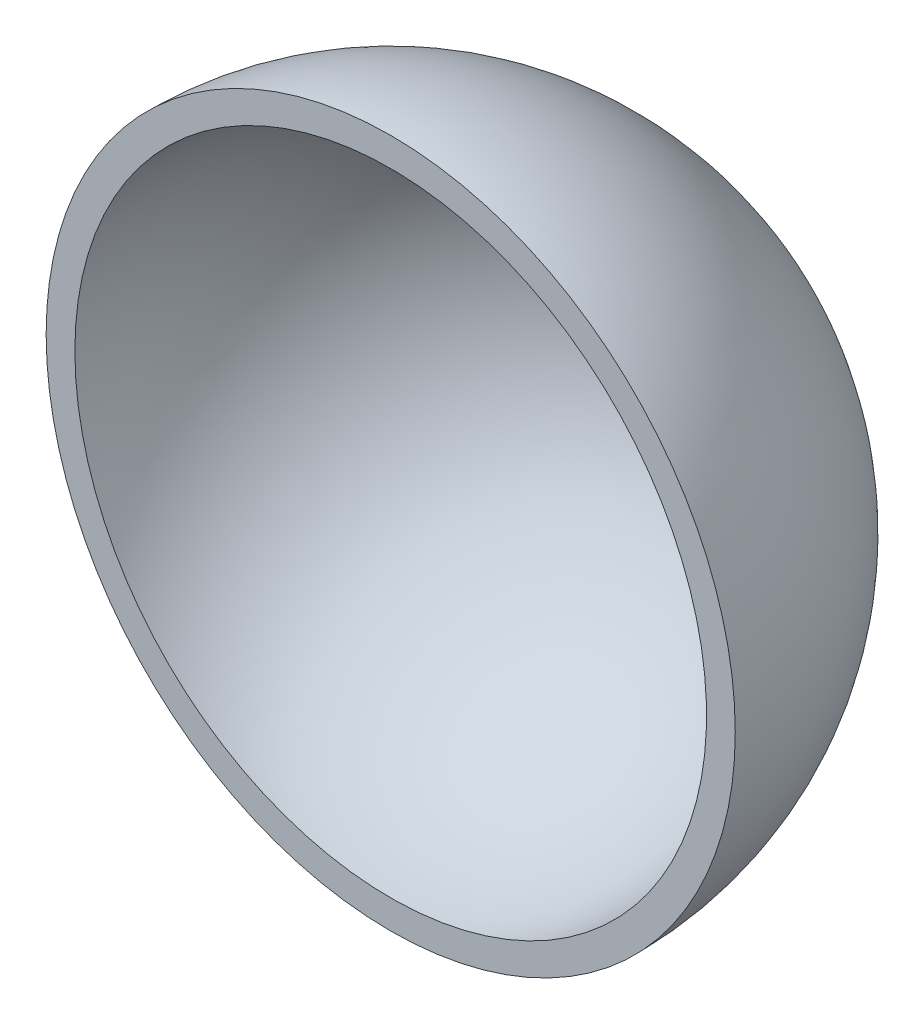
ISO-10303-21;
HEADER;
FILE_DESCRIPTION(('STEP AP214'),'2;1');
FILE_NAME('part.step','',(''),(''),'','','');
FILE_SCHEMA(('AUTOMOTIVE_DESIGN { 1 0 10303 214 1 1 1 1 }'));
ENDSEC;
DATA;
#1=APPLICATION_CONTEXT('core data for automotive mechanical design processes');
#2=APPLICATION_PROTOCOL_DEFINITION('international standard','automotive_design',2000,#1);
#3=PRODUCT_CONTEXT('',#1,'mechanical');
#4=PRODUCT('Part','Part','',(#3));
#5=PRODUCT_RELATED_PRODUCT_CATEGORY('part','',(#4));
#6=PRODUCT_DEFINITION_FORMATION('','',#4);
#7=PRODUCT_DEFINITION_CONTEXT('part definition',#1,'design');
#8=PRODUCT_DEFINITION('design','',#6,#7);
#9=PRODUCT_DEFINITION_SHAPE('','',#8);
#10=(LENGTH_UNIT() NAMED_UNIT(*) SI_UNIT(.MILLI.,.METRE.));
#11=(NAMED_UNIT(*) PLANE_ANGLE_UNIT() SI_UNIT($,.RADIAN.));
#12=(NAMED_UNIT(*) SI_UNIT($,.STERADIAN.) SOLID_ANGLE_UNIT());
#13=UNCERTAINTY_MEASURE_WITH_UNIT(LENGTH_MEASURE(1.E-05),#10,'distance_accuracy_value','');
#14=(GEOMETRIC_REPRESENTATION_CONTEXT(3) GLOBAL_UNCERTAINTY_ASSIGNED_CONTEXT((#13)) GLOBAL_UNIT_ASSIGNED_CONTEXT((#10,
#11,#12)) REPRESENTATION_CONTEXT('',''));
#15=CARTESIAN_POINT('',(0.,0.,0.));
#16=DIRECTION('',(0.,0.,1.));
#17=DIRECTION('',(1.,0.,0.));
#18=AXIS2_PLACEMENT_3D('',#15,#16,#17);
#19=CARTESIAN_POINT('',(0.,0.,0.));
#20=DIRECTION('',(0.,0.,-1.));
#21=DIRECTION('',(1.,0.,0.));
#22=AXIS2_PLACEMENT_3D('',#19,#20,#21);
#23=SPHERICAL_SURFACE('',#22,24.);
#24=CARTESIAN_POINT('',(0.,0.,0.));
#25=DIRECTION('',(0.,0.,-1.));
#26=DIRECTION('',(-1.,0.,0.));
#27=AXIS2_PLACEMENT_3D('',#24,#25,#26);
#28=CIRCLE('',#27,24.);
#29=CARTESIAN_POINT('',(-24.,0.,0.));
#30=VERTEX_POINT('',#29);
#31=EDGE_CURVE('E41',#30,#30,#28,.T.);
#32=ORIENTED_EDGE('',*,*,#31,.T.);
#33=EDGE_LOOP('',(#32));
#34=FACE_BOUND('',#33,.T.);
#35=ADVANCED_FACE('F35',(#34),#23,.T.);
#36=CARTESIAN_POINT('',(0.,0.,0.));
#37=DIRECTION('',(0.,0.,-1.));
#38=DIRECTION('',(-1.,0.,0.));
#39=AXIS2_PLACEMENT_3D('',#36,#37,#38);
#40=SPHERICAL_SURFACE('',#39,22.);
#41=CARTESIAN_POINT('',(0.,0.,0.));
#42=DIRECTION('',(0.,0.,-1.));
#43=DIRECTION('',(-1.,0.,0.));
#44=AXIS2_PLACEMENT_3D('',#41,#42,#43);
#45=CIRCLE('',#44,22.);
#46=CARTESIAN_POINT('',(-22.,0.,0.));
#47=VERTEX_POINT('',#46);
#48=EDGE_CURVE('E10',#47,#47,#45,.T.);
#49=ORIENTED_EDGE('',*,*,#48,.F.);
#50=EDGE_LOOP('',(#49));
#51=FACE_BOUND('',#50,.T.);
#52=ADVANCED_FACE('F50',(#51),#40,.F.);
#53=CARTESIAN_POINT('',(-24.,0.,0.));
#54=DIRECTION('',(0.,0.,1.));
#55=DIRECTION('',(1.,0.,0.));
#56=AXIS2_PLACEMENT_3D('',#53,#54,#55);
#57=PLANE('',#56);
#58=ORIENTED_EDGE('',*,*,#48,.T.);
#59=EDGE_LOOP('',(#58));
#60=FACE_BOUND('',#59,.T.);
#61=ORIENTED_EDGE('',*,*,#31,.F.);
#62=EDGE_LOOP('',(#61));
#63=FACE_BOUND('',#62,.T.);
#64=ADVANCED_FACE('F48',(#60,#63),#57,.T.);
#65=CLOSED_SHELL('',(#35,#52,#64));
#66=MANIFOLD_SOLID_BREP('B2',#65);
#67=ADVANCED_BREP_SHAPE_REPRESENTATION('',(#18,#66),#14);
#68=SHAPE_DEFINITION_REPRESENTATION(#9,#67);
ENDSEC;
END-ISO-10303-21;
